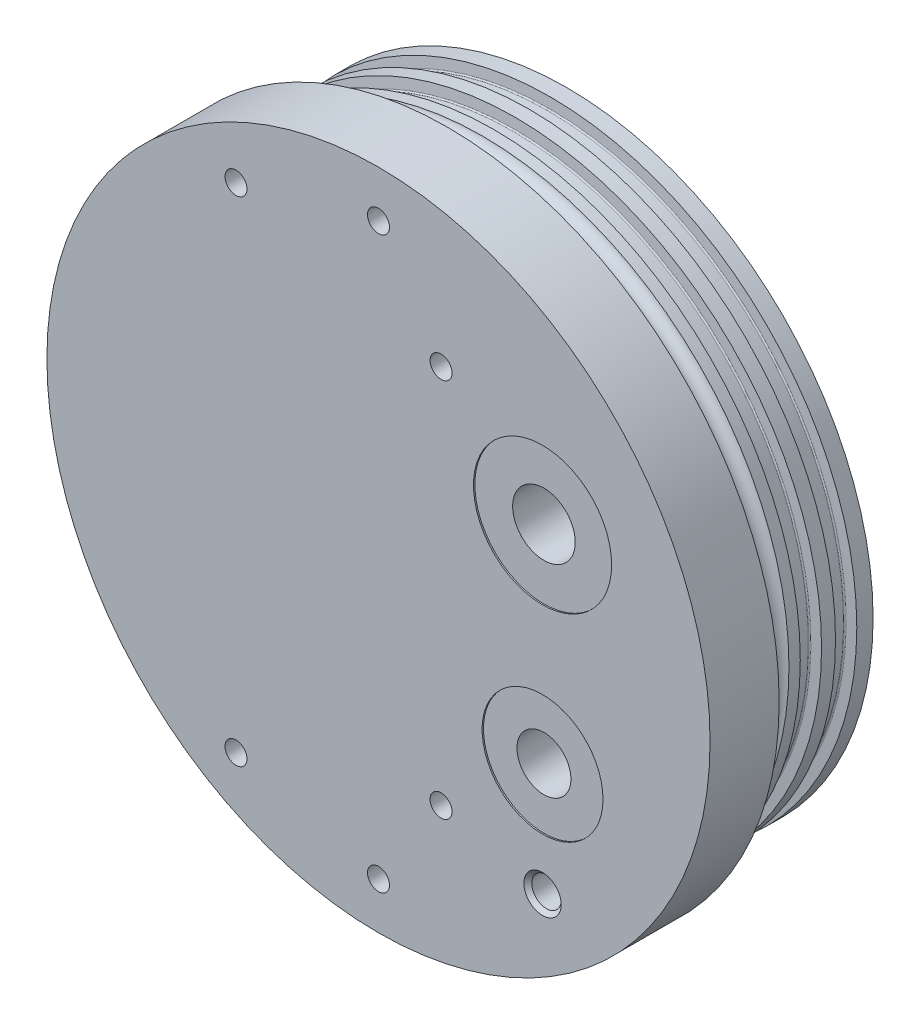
ISO-10303-21;
HEADER;
FILE_DESCRIPTION(('STEP AP214'),'2;1');
FILE_NAME('part.step','',(''),(''),'','','');
FILE_SCHEMA(('AUTOMOTIVE_DESIGN { 1 0 10303 214 1 1 1 1 }'));
ENDSEC;
DATA;
#1=APPLICATION_CONTEXT('core data for automotive mechanical design processes');
#2=APPLICATION_PROTOCOL_DEFINITION('international standard','automotive_design',2000,#1);
#3=PRODUCT_CONTEXT('',#1,'mechanical');
#4=PRODUCT('Part','Part','',(#3));
#5=PRODUCT_RELATED_PRODUCT_CATEGORY('part','',(#4));
#6=PRODUCT_DEFINITION_FORMATION('','',#4);
#7=PRODUCT_DEFINITION_CONTEXT('part definition',#1,'design');
#8=PRODUCT_DEFINITION('design','',#6,#7);
#9=PRODUCT_DEFINITION_SHAPE('','',#8);
#10=(LENGTH_UNIT() NAMED_UNIT(*) SI_UNIT(.MILLI.,.METRE.));
#11=(NAMED_UNIT(*) PLANE_ANGLE_UNIT() SI_UNIT($,.RADIAN.));
#12=(NAMED_UNIT(*) SI_UNIT($,.STERADIAN.) SOLID_ANGLE_UNIT());
#13=UNCERTAINTY_MEASURE_WITH_UNIT(LENGTH_MEASURE(1.E-05),#10,'distance_accuracy_value','');
#14=(GEOMETRIC_REPRESENTATION_CONTEXT(3) GLOBAL_UNCERTAINTY_ASSIGNED_CONTEXT((#13)) GLOBAL_UNIT_ASSIGNED_CONTEXT((#10,
#11,#12)) REPRESENTATION_CONTEXT('',''));
#15=CARTESIAN_POINT('',(0.,0.,0.));
#16=DIRECTION('',(0.,0.,1.));
#17=DIRECTION('',(1.,0.,0.));
#18=AXIS2_PLACEMENT_3D('',#15,#16,#17);
#19=CARTESIAN_POINT('',(0.,0.,12.7));
#20=DIRECTION('',(0.,0.,1.));
#21=DIRECTION('',(1.,0.,0.));
#22=AXIS2_PLACEMENT_3D('',#19,#20,#21);
#23=PLANE('',#22);
#24=CARTESIAN_POINT('',(0.,0.,12.7));
#25=DIRECTION('',(0.,0.,1.));
#26=DIRECTION('',(1.,0.,0.));
#27=AXIS2_PLACEMENT_3D('',#24,#25,#26);
#28=CIRCLE('',#27,60.96);
#29=CARTESIAN_POINT('',(60.96,0.,12.7));
#30=VERTEX_POINT('',#29);
#31=EDGE_CURVE('E208',#30,#30,#28,.T.);
#32=ORIENTED_EDGE('',*,*,#31,.T.);
#33=EDGE_LOOP('',(#32));
#34=FACE_BOUND('',#33,.T.);
#35=CARTESIAN_POINT('',(30.1625,-19.05,12.7));
#36=DIRECTION('',(0.,0.,1.));
#37=DIRECTION('',(1.,0.,0.));
#38=AXIS2_PLACEMENT_3D('',#35,#36,#37);
#39=CIRCLE('',#38,11.1125);
#40=CARTESIAN_POINT('',(41.275,-19.05,12.7));
#41=VERTEX_POINT('',#40);
#42=EDGE_CURVE('E147',#41,#41,#39,.T.);
#43=ORIENTED_EDGE('',*,*,#42,.F.);
#44=EDGE_LOOP('',(#43));
#45=FACE_BOUND('',#44,.T.);
#46=CARTESIAN_POINT('',(30.1625,19.05,12.7));
#47=DIRECTION('',(0.,0.,1.));
#48=DIRECTION('',(1.,0.,0.));
#49=AXIS2_PLACEMENT_3D('',#46,#47,#48);
#50=CIRCLE('',#49,12.7);
#51=CARTESIAN_POINT('',(42.8625,19.05,12.7));
#52=VERTEX_POINT('',#51);
#53=EDGE_CURVE('E136',#52,#52,#50,.T.);
#54=ORIENTED_EDGE('',*,*,#53,.F.);
#55=EDGE_LOOP('',(#54));
#56=FACE_BOUND('',#55,.T.);
#57=CARTESIAN_POINT('',(0.,-52.3875,12.7));
#58=DIRECTION('',(0.,0.,1.));
#59=DIRECTION('',(1.,0.,0.));
#60=AXIS2_PLACEMENT_3D('',#57,#58,#59);
#61=CIRCLE('',#60,2.0193);
#62=CARTESIAN_POINT('',(2.0193,-52.3875,12.7));
#63=VERTEX_POINT('',#62);
#64=EDGE_CURVE('E130',#63,#63,#61,.T.);
#65=ORIENTED_EDGE('',*,*,#64,.F.);
#66=EDGE_LOOP('',(#65));
#67=FACE_BOUND('',#66,.T.);
#68=CARTESIAN_POINT('',(-26.19375,-45.3689058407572,12.7));
#69=DIRECTION('',(0.,0.,1.));
#70=DIRECTION('',(0.866025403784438,-0.500000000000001,0.));
#71=AXIS2_PLACEMENT_3D('',#68,#69,#70);
#72=CIRCLE('',#71,2.0193);
#73=CARTESIAN_POINT('',(-24.4449849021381,-46.3785558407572,12.7));
#74=VERTEX_POINT('',#73);
#75=EDGE_CURVE('E124',#74,#74,#72,.T.);
#76=ORIENTED_EDGE('',*,*,#75,.F.);
#77=EDGE_LOOP('',(#76));
#78=FACE_BOUND('',#77,.T.);
#79=CARTESIAN_POINT('',(-26.1937499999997,45.3689058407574,12.7));
#80=DIRECTION('',(0.,0.,1.));
#81=DIRECTION('',(-0.866025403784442,-0.499999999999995,0.));
#82=AXIS2_PLACEMENT_3D('',#79,#80,#81);
#83=CIRCLE('',#82,2.0193);
#84=CARTESIAN_POINT('',(-27.9425150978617,44.3592558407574,12.7));
#85=VERTEX_POINT('',#84);
#86=EDGE_CURVE('E118',#85,#85,#83,.T.);
#87=ORIENTED_EDGE('',*,*,#86,.F.);
#88=EDGE_LOOP('',(#87));
#89=FACE_BOUND('',#88,.T.);
#90=CARTESIAN_POINT('',(0.,52.3875,12.7));
#91=DIRECTION('',(0.,0.,1.));
#92=DIRECTION('',(-1.,0.,0.));
#93=AXIS2_PLACEMENT_3D('',#90,#91,#92);
#94=CIRCLE('',#93,2.0193);
#95=CARTESIAN_POINT('',(-2.0193,52.3875,12.7));
#96=VERTEX_POINT('',#95);
#97=EDGE_CURVE('E112',#96,#96,#94,.T.);
#98=ORIENTED_EDGE('',*,*,#97,.F.);
#99=EDGE_LOOP('',(#98));
#100=FACE_BOUND('',#99,.T.);
#101=CARTESIAN_POINT('',(11.5062,-34.925,12.7));
#102=DIRECTION('',(0.,0.,1.));
#103=DIRECTION('',(1.,0.,0.));
#104=AXIS2_PLACEMENT_3D('',#101,#102,#103);
#105=CIRCLE('',#104,2.01929999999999);
#106=CARTESIAN_POINT('',(13.5255,-34.925,12.7));
#107=VERTEX_POINT('',#106);
#108=EDGE_CURVE('E99',#107,#107,#105,.T.);
#109=ORIENTED_EDGE('',*,*,#108,.F.);
#110=EDGE_LOOP('',(#109));
#111=FACE_BOUND('',#110,.T.);
#112=CARTESIAN_POINT('',(11.5062,34.925,12.7));
#113=DIRECTION('',(0.,0.,1.));
#114=DIRECTION('',(1.,0.,0.));
#115=AXIS2_PLACEMENT_3D('',#112,#113,#114);
#116=CIRCLE('',#115,2.01929999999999);
#117=CARTESIAN_POINT('',(13.5255,34.925,12.7));
#118=VERTEX_POINT('',#117);
#119=EDGE_CURVE('E100',#118,#118,#116,.T.);
#120=ORIENTED_EDGE('',*,*,#119,.F.);
#121=EDGE_LOOP('',(#120));
#122=FACE_BOUND('',#121,.T.);
#123=CARTESIAN_POINT('',(30.1625,-39.6875,12.6999999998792));
#124=DIRECTION('',(0.,0.,1.));
#125=DIRECTION('',(1.,0.,0.));
#126=AXIS2_PLACEMENT_3D('',#123,#124,#125);
#127=CIRCLE('',#126,3.42899703);
#128=CARTESIAN_POINT('',(33.59149703,-39.6875,12.6999999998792));
#129=VERTEX_POINT('',#128);
#130=EDGE_CURVE('E106',#129,#129,#127,.T.);
#131=ORIENTED_EDGE('',*,*,#130,.F.);
#132=EDGE_LOOP('',(#131));
#133=FACE_BOUND('',#132,.T.);
#134=ADVANCED_FACE('F38',(#34,#45,#56,#67,#78,#89,#100,#111,#122,#133),#23,.T.);
#135=CARTESIAN_POINT('',(30.1625,19.05,12.7));
#136=DIRECTION('',(0.,0.,1.));
#137=DIRECTION('',(1.,0.,0.));
#138=AXIS2_PLACEMENT_3D('',#135,#136,#137);
#139=CYLINDRICAL_SURFACE('',#138,5.75436999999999);
#140=CARTESIAN_POINT('',(30.1625,19.05,-3.175));
#141=DIRECTION('',(0.,0.,-1.));
#142=DIRECTION('',(0.,1.,0.));
#143=AXIS2_PLACEMENT_3D('',#140,#141,#142);
#144=CIRCLE('',#143,5.75436999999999);
#145=CARTESIAN_POINT('',(35.7870391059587,17.8345437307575,-3.175));
#146=VERTEX_POINT('',#145);
#147=CARTESIAN_POINT('',(31.4818602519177,24.6510769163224,-3.17500000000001));
#148=VERTEX_POINT('',#147);
#149=EDGE_CURVE('E57',#146,#148,#144,.T.);
#150=ORIENTED_EDGE('',*,*,#149,.T.);
#151=CARTESIAN_POINT('',(31.4816804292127,24.6511192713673,-3.1748));
#152=CARTESIAN_POINT('',(31.6060276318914,24.6217953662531,-3.31307528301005));
#153=CARTESIAN_POINT('',(31.7319293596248,24.587805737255,-3.44910827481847));
#154=CARTESIAN_POINT('',(31.9868954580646,24.5091506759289,-3.71576299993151));
#155=CARTESIAN_POINT('',(32.1159680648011,24.4644540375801,-3.84636758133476));
#156=CARTESIAN_POINT('',(32.3786479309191,24.3624002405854,-4.10241121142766));
#157=CARTESIAN_POINT('',(32.5122946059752,24.3048544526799,-4.22773624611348));
#158=CARTESIAN_POINT('',(32.7812969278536,24.1760990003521,-4.46887211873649));
#159=CARTESIAN_POINT('',(32.9166502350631,24.1049064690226,-4.58469462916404));
#160=CARTESIAN_POINT('',(33.2194134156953,23.9290726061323,-4.82979891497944));
#161=CARTESIAN_POINT('',(33.3870495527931,23.8205044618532,-4.95606704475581));
#162=CARTESIAN_POINT('',(33.7195278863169,23.5779527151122,-5.18407978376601));
#163=CARTESIAN_POINT('',(33.8843796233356,23.4440934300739,-5.28593903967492));
#164=CARTESIAN_POINT('',(34.1793003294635,23.1744335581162,-5.44374424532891));
#165=CARTESIAN_POINT('',(34.31053568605,23.0427922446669,-5.50454229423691));
#166=CARTESIAN_POINT('',(34.5636089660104,22.7619609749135,-5.60017558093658));
#167=CARTESIAN_POINT('',(34.6854485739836,22.6127741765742,-5.63501548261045));
#168=CARTESIAN_POINT('',(34.9155621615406,22.2994737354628,-5.67568289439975));
#169=CARTESIAN_POINT('',(35.0237737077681,22.1352969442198,-5.68138130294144));
#170=CARTESIAN_POINT('',(35.2221171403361,21.7979715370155,-5.66283765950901));
#171=CARTESIAN_POINT('',(35.3122465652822,21.6248217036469,-5.63859153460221));
#172=CARTESIAN_POINT('',(35.466869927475,21.2879442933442,-5.56519543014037));
#173=CARTESIAN_POINT('',(35.5327257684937,21.1244160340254,-5.51792731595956));
#174=CARTESIAN_POINT('',(35.647413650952,20.7988083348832,-5.40287922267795));
#175=CARTESIAN_POINT('',(35.69624653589,20.6367288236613,-5.33510026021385));
#176=CARTESIAN_POINT('',(35.7997310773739,20.2323736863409,-5.14243097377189));
#177=CARTESIAN_POINT('',(35.8439060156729,19.9928109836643,-5.00626116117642));
#178=CARTESIAN_POINT('',(35.9018657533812,19.5274257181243,-4.70525868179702));
#179=CARTESIAN_POINT('',(35.9154868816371,19.3016834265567,-4.54027672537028));
#180=CARTESIAN_POINT('',(35.9174372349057,18.9706863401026,-4.27425944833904));
#181=CARTESIAN_POINT('',(35.9147508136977,18.8594717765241,-4.18040721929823));
#182=CARTESIAN_POINT('',(35.9033814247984,18.6413556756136,-3.98808690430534));
#183=CARTESIAN_POINT('',(35.894696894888,18.5344552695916,-3.88961762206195));
#184=CARTESIAN_POINT('',(35.8721320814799,18.3263321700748,-3.69016020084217));
#185=CARTESIAN_POINT('',(35.8583217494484,18.2250532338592,-3.58922233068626));
#186=CARTESIAN_POINT('',(35.8260309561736,18.0266495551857,-3.3842320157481));
#187=CARTESIAN_POINT('',(35.807554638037,17.9295212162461,-3.28018240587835));
#188=CARTESIAN_POINT('',(35.7870000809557,17.8343631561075,-3.1748));
#189=B_SPLINE_CURVE_WITH_KNOTS('',3,(#151,#152,#153,#154,#155,#156,#157,#158,#159,#160,#161,
#162,#163,#164,#165,#166,#167,#168,#169,#170,#171,#172,#173,#174,#175,#176,#177,#178,#179,#180,
#181,#182,#183,#184,#185,#186,#187,#188),.UNSPECIFIED.,.F.,.F.,(4,2,2,2,2,2,2,2,2,2,2,2,2,2,2,2,
2,2,4),(0.,0.564862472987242,1.13139173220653,1.70685961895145,2.28160969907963,
2.98829598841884,3.69159494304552,4.27591662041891,4.86013328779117,5.44693590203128,
6.03381833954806,6.57920883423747,7.12457230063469,7.95711406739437,8.79410506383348,
9.23053424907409,9.66707714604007,10.0978693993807,10.5282804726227),.UNSPECIFIED.);
#190=EDGE_CURVE('E11',#148,#146,#189,.T.);
#191=ORIENTED_EDGE('',*,*,#190,.T.);
#192=EDGE_LOOP('',(#150,#191));
#193=FACE_BOUND('',#192,.T.);
#194=CARTESIAN_POINT('',(30.1625,19.05,12.446));
#195=DIRECTION('',(0.,0.,1.));
#196=DIRECTION('',(1.,0.,0.));
#197=AXIS2_PLACEMENT_3D('',#194,#195,#196);
#198=CIRCLE('',#197,5.75436999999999);
#199=CARTESIAN_POINT('',(35.91687,19.05,12.446));
#200=VERTEX_POINT('',#199);
#201=EDGE_CURVE('E140',#200,#200,#198,.F.);
#202=ORIENTED_EDGE('',*,*,#201,.F.);
#203=EDGE_LOOP('',(#202));
#204=FACE_BOUND('',#203,.T.);
#205=ADVANCED_FACE('F230',(#193,#204),#139,.F.);
#206=CARTESIAN_POINT('',(30.1625,-19.05,12.7));
#207=DIRECTION('',(0.,0.,1.));
#208=DIRECTION('',(1.,0.,0.));
#209=AXIS2_PLACEMENT_3D('',#206,#207,#208);
#210=CYLINDRICAL_SURFACE('',#209,4.96061999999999);
#211=CARTESIAN_POINT('',(30.1625,-19.05,-3.17500000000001));
#212=DIRECTION('',(0.,0.,-1.));
#213=DIRECTION('',(0.,1.,0.));
#214=AXIS2_PLACEMENT_3D('',#211,#212,#213);
#215=CIRCLE('',#214,4.96061999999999);
#216=CARTESIAN_POINT('',(32.3477058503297,-23.50338367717,-3.17500000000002));
#217=VERTEX_POINT('',#216);
#218=CARTESIAN_POINT('',(35.1227626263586,-19.109543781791,-3.17500000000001));
#219=VERTEX_POINT('',#218);
#220=EDGE_CURVE('E151',#217,#219,#215,.T.);
#221=ORIENTED_EDGE('',*,*,#220,.T.);
#222=CARTESIAN_POINT('',(35.1227655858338,-19.1092967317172,-3.1748));
#223=CARTESIAN_POINT('',(35.1217857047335,-19.1902253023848,-3.24030280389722));
#224=CARTESIAN_POINT('',(35.1188329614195,-19.2724131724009,-3.30417321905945));
#225=CARTESIAN_POINT('',(35.1085222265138,-19.4394405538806,-3.42819067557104));
#226=CARTESIAN_POINT('',(35.1011585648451,-19.5242833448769,-3.48833281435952));
#227=CARTESIAN_POINT('',(35.0714749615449,-19.7852764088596,-3.66397888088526));
#228=CARTESIAN_POINT('',(35.0415622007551,-19.9654478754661,-3.77268768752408));
#229=CARTESIAN_POINT('',(34.9786813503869,-20.2421478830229,-3.91741386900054));
#230=CARTESIAN_POINT('',(34.9545637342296,-20.3359078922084,-3.96276780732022));
#231=CARTESIAN_POINT('',(34.899847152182,-20.5247679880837,-4.04612612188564));
#232=CARTESIAN_POINT('',(34.8692527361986,-20.6198670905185,-4.0841356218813));
#233=CARTESIAN_POINT('',(34.8014732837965,-20.8100591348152,-4.15160540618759));
#234=CARTESIAN_POINT('',(34.7643286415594,-20.9051487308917,-4.1811153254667));
#235=CARTESIAN_POINT('',(34.683232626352,-21.0948357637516,-4.23094611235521));
#236=CARTESIAN_POINT('',(34.6392833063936,-21.1894333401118,-4.25126974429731));
#237=CARTESIAN_POINT('',(34.5516213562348,-21.3633149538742,-4.27977149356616));
#238=CARTESIAN_POINT('',(34.5087983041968,-21.4428306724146,-4.28928333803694));
#239=CARTESIAN_POINT('',(34.4186099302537,-21.5997977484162,-4.30078942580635));
#240=CARTESIAN_POINT('',(34.3712452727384,-21.6772494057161,-4.30278476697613));
#241=CARTESIAN_POINT('',(34.2724060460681,-21.8293246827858,-4.29919559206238));
#242=CARTESIAN_POINT('',(34.2209307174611,-21.9039477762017,-4.29360967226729));
#243=CARTESIAN_POINT('',(34.1144656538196,-22.0496454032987,-4.27503308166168));
#244=CARTESIAN_POINT('',(34.0594761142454,-22.1207201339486,-4.26204282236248));
#245=CARTESIAN_POINT('',(33.9068611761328,-22.3073796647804,-4.21736332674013));
#246=CARTESIAN_POINT('',(33.8064361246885,-22.4191340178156,-4.17894864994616));
#247=CARTESIAN_POINT('',(33.6000399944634,-22.6295133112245,-4.08419195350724));
#248=CARTESIAN_POINT('',(33.4940534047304,-22.7280984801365,-4.02779729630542));
#249=CARTESIAN_POINT('',(33.2151508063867,-22.9666454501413,-3.86212526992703));
#250=CARTESIAN_POINT('',(33.0401412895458,-23.0960588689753,-3.74139807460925));
#251=CARTESIAN_POINT('',(32.6915409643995,-23.3225224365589,-3.47448406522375));
#252=CARTESIAN_POINT('',(32.5179522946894,-23.419865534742,-3.32854739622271));
#253=CARTESIAN_POINT('',(32.3474840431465,-23.5034925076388,-3.17479999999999));
#254=B_SPLINE_CURVE_WITH_KNOTS('',3,(#222,#223,#224,#225,#226,#227,#228,#229,#230,#231,#232,
#233,#234,#235,#236,#237,#238,#239,#240,#241,#242,#243,#244,#245,#246,#247,#248,#249,#250,#251,
#252,#253),.UNSPECIFIED.,.F.,.F.,(4,2,2,2,2,2,2,2,2,2,2,2,2,2,2,4),(0.,0.312240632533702,
0.624883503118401,1.25960768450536,1.57997418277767,1.90011636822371,2.2183492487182,
2.53648630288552,2.808496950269,3.08046786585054,3.35248914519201,3.62449530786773,
4.0876985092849,4.55227041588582,5.2948817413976,6.03050831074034),.UNSPECIFIED.);
#255=EDGE_CURVE('E51',#219,#217,#254,.T.);
#256=ORIENTED_EDGE('',*,*,#255,.T.);
#257=EDGE_LOOP('',(#221,#256));
#258=FACE_BOUND('',#257,.T.);
#259=CARTESIAN_POINT('',(30.1625,-19.05,12.446));
#260=DIRECTION('',(0.,0.,1.));
#261=DIRECTION('',(1.,0.,0.));
#262=AXIS2_PLACEMENT_3D('',#259,#260,#261);
#263=CIRCLE('',#262,4.96061999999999);
#264=CARTESIAN_POINT('',(35.12312,-19.05,12.446));
#265=VERTEX_POINT('',#264);
#266=EDGE_CURVE('E146',#265,#265,#263,.F.);
#267=ORIENTED_EDGE('',*,*,#266,.F.);
#268=EDGE_LOOP('',(#267));
#269=FACE_BOUND('',#268,.T.);
#270=ADVANCED_FACE('F226',(#258,#269),#210,.F.);
#271=CARTESIAN_POINT('',(0.,0.,12.7));
#272=DIRECTION('',(0.,0.,-1.));
#273=DIRECTION('',(-1.,0.,0.));
#274=AXIS2_PLACEMENT_3D('',#271,#272,#273);
#275=CYLINDRICAL_SURFACE('',#274,60.96);
#276=ORIENTED_EDGE('',*,*,#31,.F.);
#277=EDGE_LOOP('',(#276));
#278=FACE_BOUND('',#277,.T.);
#279=CARTESIAN_POINT('',(0.,0.,0.));
#280=DIRECTION('',(0.,0.,1.));
#281=DIRECTION('',(1.,0.,0.));
#282=AXIS2_PLACEMENT_3D('',#279,#280,#281);
#283=CIRCLE('',#282,60.96);
#284=CARTESIAN_POINT('',(60.96,0.,0.));
#285=VERTEX_POINT('',#284);
#286=EDGE_CURVE('E207',#285,#285,#283,.T.);
#287=ORIENTED_EDGE('',*,*,#286,.T.);
#288=EDGE_LOOP('',(#287));
#289=FACE_BOUND('',#288,.T.);
#290=ADVANCED_FACE('F40',(#278,#289),#275,.T.);
#291=CARTESIAN_POINT('',(0.,0.,0.));
#292=DIRECTION('',(0.,0.,1.));
#293=DIRECTION('',(1.,0.,0.));
#294=AXIS2_PLACEMENT_3D('',#291,#292,#293);
#295=PLANE('',#294);
#296=CARTESIAN_POINT('',(0.,0.,0.));
#297=DIRECTION('',(0.,0.,-1.));
#298=DIRECTION('',(0.,1.,0.));
#299=AXIS2_PLACEMENT_3D('',#296,#297,#298);
#300=CIRCLE('',#299,56.7055);
#301=CARTESIAN_POINT('',(0.,56.7055,0.));
#302=VERTEX_POINT('',#301);
#303=EDGE_CURVE('E198',#302,#302,#300,.T.);
#304=ORIENTED_EDGE('',*,*,#303,.F.);
#305=EDGE_LOOP('',(#304));
#306=FACE_BOUND('',#305,.T.);
#307=ORIENTED_EDGE('',*,*,#286,.F.);
#308=EDGE_LOOP('',(#307));
#309=FACE_BOUND('',#308,.T.);
#310=ADVANCED_FACE('F301',(#306,#309),#295,.F.);
#311=CARTESIAN_POINT('',(0.,0.,0.));
#312=DIRECTION('',(0.,0.,-1.));
#313=DIRECTION('',(0.,1.,0.));
#314=AXIS2_PLACEMENT_3D('',#311,#312,#313);
#315=CYLINDRICAL_SURFACE('',#314,56.3245);
#316=CARTESIAN_POINT('',(0.,0.,-6.43851118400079));
#317=DIRECTION('',(0.,0.,-1.));
#318=DIRECTION('',(0.,1.,0.));
#319=AXIS2_PLACEMENT_3D('',#316,#317,#318);
#320=CIRCLE('',#319,56.3245);
#321=CARTESIAN_POINT('',(0.,56.3245,-6.43851118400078));
#322=VERTEX_POINT('',#321);
#323=EDGE_CURVE('E204',#322,#322,#320,.T.);
#324=ORIENTED_EDGE('',*,*,#323,.T.);
#325=EDGE_LOOP('',(#324));
#326=FACE_BOUND('',#325,.T.);
#327=CARTESIAN_POINT('',(0.,0.,-8.52172303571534));
#328=DIRECTION('',(0.,0.,-1.));
#329=DIRECTION('',(0.,1.,0.));
#330=AXIS2_PLACEMENT_3D('',#327,#328,#329);
#331=CIRCLE('',#330,56.3245);
#332=CARTESIAN_POINT('',(0.,56.3245,-8.52172303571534));
#333=VERTEX_POINT('',#332);
#334=EDGE_CURVE('E153',#333,#333,#331,.T.);
#335=ORIENTED_EDGE('',*,*,#334,.F.);
#336=EDGE_LOOP('',(#335));
#337=FACE_BOUND('',#336,.T.);
#338=ADVANCED_FACE('F299',(#326,#337),#315,.T.);
#339=CARTESIAN_POINT('',(0.,0.,-4.57200000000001));
#340=DIRECTION('',(0.,0.,-1.));
#341=DIRECTION('',(0.,1.,0.));
#342=AXIS2_PLACEMENT_3D('',#339,#340,#341);
#343=TOROIDAL_SURFACE('',#342,56.7055,1.905);
#344=CARTESIAN_POINT('',(0.,0.,-2.66700000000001));
#345=DIRECTION('',(0.,0.,-1.));
#346=DIRECTION('',(0.,1.,0.));
#347=AXIS2_PLACEMENT_3D('',#344,#345,#346);
#348=CIRCLE('',#347,56.7055);
#349=CARTESIAN_POINT('',(0.,56.7055,-2.667));
#350=VERTEX_POINT('',#349);
#351=EDGE_CURVE('E201',#350,#350,#348,.T.);
#352=ORIENTED_EDGE('',*,*,#351,.T.);
#353=EDGE_LOOP('',(#352));
#354=FACE_BOUND('',#353,.T.);
#355=ORIENTED_EDGE('',*,*,#323,.F.);
#356=EDGE_LOOP('',(#355));
#357=FACE_BOUND('',#356,.T.);
#358=ADVANCED_FACE('F308',(#354,#357),#343,.F.);
#359=CARTESIAN_POINT('',(0.,0.,0.));
#360=DIRECTION('',(0.,0.,-1.));
#361=DIRECTION('',(0.,1.,0.));
#362=AXIS2_PLACEMENT_3D('',#359,#360,#361);
#363=CYLINDRICAL_SURFACE('',#362,56.7055);
#364=ORIENTED_EDGE('',*,*,#303,.T.);
#365=EDGE_LOOP('',(#364));
#366=FACE_BOUND('',#365,.T.);
#367=ORIENTED_EDGE('',*,*,#351,.F.);
#368=EDGE_LOOP('',(#367));
#369=FACE_BOUND('',#368,.T.);
#370=ADVANCED_FACE('F316',(#366,#369),#363,.T.);
#371=CARTESIAN_POINT('',(0.,39.9847860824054,-3.175));
#372=DIRECTION('',(0.,0.,-1.));
#373=DIRECTION('',(0.,1.,0.));
#374=AXIS2_PLACEMENT_3D('',#371,#372,#373);
#375=PLANE('',#374);
#376=ORIENTED_EDGE('',*,*,#149,.F.);
#377=CARTESIAN_POINT('',(0.,0.,-3.17500000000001));
#378=DIRECTION('',(0.,0.,-1.));
#379=DIRECTION('',(0.,1.,0.));
#380=AXIS2_PLACEMENT_3D('',#377,#378,#379);
#381=CIRCLE('',#380,39.9847860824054);
#382=EDGE_CURVE('E64',#146,#219,#381,.T.);
#383=ORIENTED_EDGE('',*,*,#382,.T.);
#384=ORIENTED_EDGE('',*,*,#220,.F.);
#385=EDGE_CURVE('E195',#217,#148,#381,.T.);
#386=ORIENTED_EDGE('',*,*,#385,.T.);
#387=EDGE_LOOP('',(#376,#383,#384,#386));
#388=FACE_BOUND('',#387,.T.);
#389=ADVANCED_FACE('F288',(#388),#375,.T.);
#390=CARTESIAN_POINT('',(0.,0.,-3.17500000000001));
#391=DIRECTION('',(0.,0.,-1.));
#392=DIRECTION('',(0.,1.,0.));
#393=AXIS2_PLACEMENT_3D('',#390,#391,#392);
#394=CONICAL_SURFACE('',#393,39.9847860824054,0.523598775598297);
#395=CARTESIAN_POINT('',(30.1990783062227,-40.4804067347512,-21.3947039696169));
#396=CARTESIAN_POINT('',(30.1695158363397,-40.4817718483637,-21.3659815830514));
#397=CARTESIAN_POINT('',(30.1410440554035,-40.4814381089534,-21.3360608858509));
#398=CARTESIAN_POINT('',(30.0861125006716,-40.478043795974,-21.2745550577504));
#399=CARTESIAN_POINT('',(30.0596551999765,-40.4749799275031,-21.2429679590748));
#400=CARTESIAN_POINT('',(29.9827677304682,-40.4623915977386,-21.1460951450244));
#401=CARTESIAN_POINT('',(29.9351376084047,-40.4494671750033,-21.0790198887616));
#402=CARTESIAN_POINT('',(29.8518637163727,-40.4191030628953,-20.950988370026));
#403=CARTESIAN_POINT('',(29.8154658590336,-40.4024312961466,-20.8903174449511));
#404=CARTESIAN_POINT('',(29.7470358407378,-40.3649596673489,-20.7677358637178));
#405=CARTESIAN_POINT('',(29.7150072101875,-40.3441565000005,-20.7058242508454));
#406=CARTESIAN_POINT('',(29.6550627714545,-40.2990173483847,-20.5813077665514));
#407=CARTESIAN_POINT('',(29.6271476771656,-40.2746807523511,-20.5187027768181));
#408=CARTESIAN_POINT('',(29.5753023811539,-40.2228333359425,-20.393155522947));
#409=CARTESIAN_POINT('',(29.5513725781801,-40.1953221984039,-20.3302132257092));
#410=CARTESIAN_POINT('',(29.5059775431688,-40.1353066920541,-20.1998883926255));
#411=CARTESIAN_POINT('',(29.4848021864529,-40.1025875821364,-20.1325035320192));
#412=CARTESIAN_POINT('',(29.4472275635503,-40.0338519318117,-19.9980355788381));
#413=CARTESIAN_POINT('',(29.4308306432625,-39.9978337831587,-19.9309526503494));
#414=CARTESIAN_POINT('',(29.4032832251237,-39.9225237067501,-19.7976195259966));
#415=CARTESIAN_POINT('',(29.392127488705,-39.8832350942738,-19.7313685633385));
#416=CARTESIAN_POINT('',(29.3758315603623,-39.801247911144,-19.6003290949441));
#417=CARTESIAN_POINT('',(29.3706848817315,-39.7585530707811,-19.5355390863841));
#418=CARTESIAN_POINT('',(29.3676983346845,-39.6693943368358,-19.4082988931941));
#419=CARTESIAN_POINT('',(29.3698568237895,-39.6229312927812,-19.3458481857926));
#420=CARTESIAN_POINT('',(29.3803253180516,-39.5502718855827,-19.2556049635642));
#421=CARTESIAN_POINT('',(29.3850033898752,-39.525610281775,-19.2261516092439));
#422=CARTESIAN_POINT('',(29.3972169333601,-39.4752411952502,-19.1687875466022));
#423=CARTESIAN_POINT('',(29.4047495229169,-39.4495347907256,-19.1408753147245));
#424=CARTESIAN_POINT('',(29.4220210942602,-39.4006041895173,-19.0908377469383));
#425=CARTESIAN_POINT('',(29.4313274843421,-39.3775107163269,-19.0684388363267));
#426=CARTESIAN_POINT('',(29.4530456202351,-39.3305931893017,-19.02590400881));
#427=CARTESIAN_POINT('',(29.4654615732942,-39.3067681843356,-19.0057712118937));
#428=CARTESIAN_POINT('',(29.4941603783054,-39.2583557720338,-18.9685395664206));
#429=CARTESIAN_POINT('',(29.5104942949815,-39.233762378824,-18.951486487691));
#430=CARTESIAN_POINT('',(29.5474224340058,-39.1848609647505,-18.9223067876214));
#431=CARTESIAN_POINT('',(29.5680000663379,-39.1605522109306,-18.910161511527));
#432=CARTESIAN_POINT('',(29.6058271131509,-39.1212541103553,-18.8953812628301));
#433=CARTESIAN_POINT('',(29.6219275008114,-39.105840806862,-18.8909295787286));
#434=CARTESIAN_POINT('',(29.6557086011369,-39.0761859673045,-18.885350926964));
#435=CARTESIAN_POINT('',(29.6733882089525,-39.0619436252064,-18.8842216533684));
#436=CARTESIAN_POINT('',(29.7098390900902,-39.0350812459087,-18.8853991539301));
#437=CARTESIAN_POINT('',(29.7286107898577,-39.022461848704,-18.8877072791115));
#438=CARTESIAN_POINT('',(29.7666611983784,-38.9991321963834,-18.8955380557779));
#439=CARTESIAN_POINT('',(29.7859402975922,-38.9884234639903,-18.9010632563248));
#440=CARTESIAN_POINT('',(29.8301805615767,-38.9661234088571,-18.9169252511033));
#441=CARTESIAN_POINT('',(29.8551405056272,-38.9552033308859,-18.9282005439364));
#442=CARTESIAN_POINT('',(29.9043461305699,-38.9364386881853,-18.9542918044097));
#443=CARTESIAN_POINT('',(29.9285902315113,-38.9286005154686,-18.9691150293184));
#444=CARTESIAN_POINT('',(29.9894511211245,-38.9118843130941,-19.0104579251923));
#445=CARTESIAN_POINT('',(30.025307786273,-38.9049268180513,-19.0388503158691));
#446=CARTESIAN_POINT('',(30.0942262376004,-38.895925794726,-19.0995031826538));
#447=CARTESIAN_POINT('',(30.1272804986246,-38.8938951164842,-19.1317735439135));
#448=CARTESIAN_POINT('',(30.1884083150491,-38.8936303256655,-19.1962901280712));
#449=CARTESIAN_POINT('',(30.2166694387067,-38.8951263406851,-19.2283613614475));
#450=CARTESIAN_POINT('',(30.2711613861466,-38.900746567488,-19.2939798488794));
#451=CARTESIAN_POINT('',(30.2973904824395,-38.9048729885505,-19.327528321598));
#452=CARTESIAN_POINT('',(30.3733727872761,-38.9205182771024,-19.4297985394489));
#453=CARTESIAN_POINT('',(30.4203629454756,-38.9353014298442,-19.5000809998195));
#454=CARTESIAN_POINT('',(30.5039218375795,-38.9696523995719,-19.6361077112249));
#455=CARTESIAN_POINT('',(30.5410535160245,-38.9886466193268,-19.7016652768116));
#456=CARTESIAN_POINT('',(30.6106394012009,-39.0310913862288,-19.8338776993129));
#457=CARTESIAN_POINT('',(30.6430898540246,-39.054545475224,-19.900533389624));
#458=CARTESIAN_POINT('',(30.7036039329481,-39.105424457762,-20.0345694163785));
#459=CARTESIAN_POINT('',(30.7316542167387,-39.1328609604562,-20.101951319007));
#460=CARTESIAN_POINT('',(30.7832960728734,-39.1913419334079,-20.2368593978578));
#461=CARTESIAN_POINT('',(30.8068874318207,-39.2223865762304,-20.3043855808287));
#462=CARTESIAN_POINT('',(30.8505719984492,-39.2896462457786,-20.4427391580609));
#463=CARTESIAN_POINT('',(30.8704183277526,-39.3260465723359,-20.5135548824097));
#464=CARTESIAN_POINT('',(30.9045851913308,-39.4026980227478,-20.6545348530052));
#465=CARTESIAN_POINT('',(30.9189007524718,-39.4429525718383,-20.7246984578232));
#466=CARTESIAN_POINT('',(30.9411382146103,-39.5273109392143,-20.8634742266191));
#467=CARTESIAN_POINT('',(30.9490783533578,-39.5714033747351,-20.9320902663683));
#468=CARTESIAN_POINT('',(30.9572485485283,-39.6637343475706,-21.0668218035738));
#469=CARTESIAN_POINT('',(30.9574948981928,-39.7119639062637,-21.1329422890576));
#470=CARTESIAN_POINT('',(30.9485870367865,-39.8058242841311,-21.2517491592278));
#471=CARTESIAN_POINT('',(30.9407827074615,-39.8508276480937,-21.3049981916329));
#472=CARTESIAN_POINT('',(30.921568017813,-39.9208015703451,-21.380397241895));
#473=CARTESIAN_POINT('',(30.9139449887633,-39.9444647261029,-21.4047196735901));
#474=CARTESIAN_POINT('',(30.895727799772,-39.9925877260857,-21.451357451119));
#475=CARTESIAN_POINT('',(30.8851382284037,-40.0170462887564,-21.4736758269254));
#476=CARTESIAN_POINT('',(30.862746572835,-40.0619300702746,-21.5115610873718));
#477=CARTESIAN_POINT('',(30.8515488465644,-40.082246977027,-21.5276077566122));
#478=CARTESIAN_POINT('',(30.8264783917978,-40.1230984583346,-21.5572268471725));
#479=CARTESIAN_POINT('',(30.8126042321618,-40.1436331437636,-21.5707979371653));
#480=CARTESIAN_POINT('',(30.7817513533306,-40.1847255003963,-21.5947618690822));
#481=CARTESIAN_POINT('',(30.7647392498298,-40.2052807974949,-21.6051169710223));
#482=CARTESIAN_POINT('',(30.7277388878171,-40.2454287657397,-21.6214470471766));
#483=CARTESIAN_POINT('',(30.707756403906,-40.2650232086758,-21.6274303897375));
#484=CARTESIAN_POINT('',(30.6671204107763,-40.3007415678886,-21.6339935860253));
#485=CARTESIAN_POINT('',(30.6466707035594,-40.3170189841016,-21.6349920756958));
#486=CARTESIAN_POINT('',(30.6044305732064,-40.3473578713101,-21.6325981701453));
#487=CARTESIAN_POINT('',(30.5826400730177,-40.361419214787,-21.6292055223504));
#488=CARTESIAN_POINT('',(30.5412733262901,-40.3854053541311,-21.6190883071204));
#489=CARTESIAN_POINT('',(30.521751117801,-40.3956254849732,-21.6128205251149));
#490=CARTESIAN_POINT('',(30.4827905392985,-40.4140798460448,-21.5976730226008));
#491=CARTESIAN_POINT('',(30.463352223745,-40.4223129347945,-21.5887918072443));
#492=CARTESIAN_POINT('',(30.4132124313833,-40.4413403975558,-21.5628782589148));
#493=CARTESIAN_POINT('',(30.3828235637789,-40.4506636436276,-21.5441677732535));
#494=CARTESIAN_POINT('',(30.323703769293,-40.4653078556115,-21.5030051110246));
#495=CARTESIAN_POINT('',(30.2949759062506,-40.4706216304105,-21.4805462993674));
#496=CARTESIAN_POINT('',(30.243834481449,-40.4774209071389,-21.436929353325));
#497=CARTESIAN_POINT('',(30.2211523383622,-40.4793874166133,-21.4161507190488));
#498=CARTESIAN_POINT('',(30.1990783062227,-40.4804067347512,-21.3947039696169));
#499=B_SPLINE_CURVE_WITH_KNOTS('',3,(#395,#396,#397,#398,#399,#400,#401,#402,#403,#404,#405,
#406,#407,#408,#409,#410,#411,#412,#413,#414,#415,#416,#417,#418,#419,#420,#421,#422,#423,#424,
#425,#426,#427,#428,#429,#430,#431,#432,#433,#434,#435,#436,#437,#438,#439,#440,#441,#442,#443,
#444,#445,#446,#447,#448,#449,#450,#451,#452,#453,#454,#455,#456,#457,#458,#459,#460,#461,#462,
#463,#464,#465,#466,#467,#468,#469,#470,#471,#472,#473,#474,#475,#476,#477,#478,#479,#480,#481,
#482,#483,#484,#485,#486,#487,#488,#489,#490,#491,#492,#493,#494,#495,#496,#497,#498),
.UNSPECIFIED.,.T.,.F.,(4,2,2,2,2,2,2,2,2,2,2,2,2,2,2,2,2,2,2,2,2,2,2,2,2,2,2,2,2,2,2,2,2,2,2,2,
2,2,2,2,2,2,2,2,2,2,2,2,2,2,2,4),(0.,0.123677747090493,0.247504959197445,0.496496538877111,
0.714313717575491,0.932305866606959,1.15033580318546,1.36838754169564,1.60170662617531,
1.83514006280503,2.06833968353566,2.30128733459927,2.53418261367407,2.65016657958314,
2.76603375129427,2.86632868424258,2.96676005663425,3.06857926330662,3.17000772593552,
3.23790122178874,3.30574758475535,3.37362062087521,3.44154750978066,3.52950885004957,
3.61765167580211,3.75566182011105,3.89403153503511,4.02216004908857,4.15039632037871,
4.40712574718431,4.63995331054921,4.87296655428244,5.10667323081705,5.34039108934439,
5.58630871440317,5.83244695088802,6.07787854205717,6.32279034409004,6.53240047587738,
6.63659624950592,6.74063173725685,6.8250659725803,6.909545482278,6.99498186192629,
7.08025426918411,7.15822853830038,7.23620729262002,7.30467648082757,7.37318490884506,
7.48320741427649,7.59342678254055,7.6857758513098),.UNSPECIFIED.);
#500=CARTESIAN_POINT('',(30.1990783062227,-40.4804067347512,-21.3947039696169));
#501=VERTEX_POINT('',#500);
#502=EDGE_CURVE('E42',#501,#501,#499,.T.);
#503=ORIENTED_EDGE('',*,*,#502,.F.);
#504=EDGE_LOOP('',(#503));
#505=FACE_BOUND('',#504,.T.);
#506=ORIENTED_EDGE('',*,*,#190,.F.);
#507=ORIENTED_EDGE('',*,*,#385,.F.);
#508=ORIENTED_EDGE('',*,*,#255,.F.);
#509=ORIENTED_EDGE('',*,*,#382,.F.);
#510=EDGE_LOOP('',(#506,#507,#508,#509));
#511=FACE_BOUND('',#510,.T.);
#512=CARTESIAN_POINT('',(0.,0.,-21.9075));
#513=DIRECTION('',(0.,0.,-1.));
#514=DIRECTION('',(0.,1.,0.));
#515=AXIS2_PLACEMENT_3D('',#512,#513,#514);
#516=CIRCLE('',#515,50.8);
#517=CARTESIAN_POINT('',(0.,50.8,-21.9075));
#518=VERTEX_POINT('',#517);
#519=EDGE_CURVE('E192',#518,#518,#516,.T.);
#520=ORIENTED_EDGE('',*,*,#519,.T.);
#521=EDGE_LOOP('',(#520));
#522=FACE_BOUND('',#521,.T.);
#523=ADVANCED_FACE('F222',(#505,#511,#522),#394,.F.);
#524=CARTESIAN_POINT('',(0.,56.3245,-21.9075));
#525=DIRECTION('',(0.,0.,-1.));
#526=DIRECTION('',(0.,1.,0.));
#527=AXIS2_PLACEMENT_3D('',#524,#525,#526);
#528=PLANE('',#527);
#529=CARTESIAN_POINT('',(0.,0.,-21.9075));
#530=DIRECTION('',(0.,0.,-1.));
#531=DIRECTION('',(0.,1.,0.));
#532=AXIS2_PLACEMENT_3D('',#529,#530,#531);
#533=CIRCLE('',#532,56.3245);
#534=CARTESIAN_POINT('',(0.,56.3245,-21.9075));
#535=VERTEX_POINT('',#534);
#536=EDGE_CURVE('E189',#535,#535,#533,.T.);
#537=ORIENTED_EDGE('',*,*,#536,.T.);
#538=EDGE_LOOP('',(#537));
#539=FACE_BOUND('',#538,.T.);
#540=ORIENTED_EDGE('',*,*,#519,.F.);
#541=EDGE_LOOP('',(#540));
#542=FACE_BOUND('',#541,.T.);
#543=ADVANCED_FACE('F281',(#539,#542),#528,.T.);
#544=CARTESIAN_POINT('',(0.,0.,0.));
#545=DIRECTION('',(0.,0.,-1.));
#546=DIRECTION('',(0.,1.,0.));
#547=AXIS2_PLACEMENT_3D('',#544,#545,#546);
#548=CYLINDRICAL_SURFACE('',#547,56.3245);
#549=CARTESIAN_POINT('',(0.,0.,-18.9102769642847));
#550=DIRECTION('',(0.,0.,-1.));
#551=DIRECTION('',(0.,1.,0.));
#552=AXIS2_PLACEMENT_3D('',#549,#550,#551);
#553=CIRCLE('',#552,56.3245);
#554=CARTESIAN_POINT('',(0.,56.3245,-18.9102769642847));
#555=VERTEX_POINT('',#554);
#556=EDGE_CURVE('E186',#555,#555,#553,.T.);
#557=ORIENTED_EDGE('',*,*,#556,.T.);
#558=EDGE_LOOP('',(#557));
#559=FACE_BOUND('',#558,.T.);
#560=ORIENTED_EDGE('',*,*,#536,.F.);
#561=EDGE_LOOP('',(#560));
#562=FACE_BOUND('',#561,.T.);
#563=ADVANCED_FACE('F278',(#559,#562),#548,.T.);
#564=CARTESIAN_POINT('',(0.,0.,-18.9102769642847));
#565=DIRECTION('',(0.,0.,-1.));
#566=DIRECTION('',(0.,1.,0.));
#567=AXIS2_PLACEMENT_3D('',#564,#565,#566);
#568=CONICAL_SURFACE('',#567,56.3245,1.48352986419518);
#569=CARTESIAN_POINT('',(0.,0.,-18.7527853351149));
#570=DIRECTION('',(0.,0.,-1.));
#571=DIRECTION('',(0.,1.,0.));
#572=AXIS2_PLACEMENT_3D('',#569,#570,#571);
#573=CIRCLE('',#572,54.5243624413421);
#574=CARTESIAN_POINT('',(0.,54.5243624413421,-18.7527853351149));
#575=VERTEX_POINT('',#574);
#576=EDGE_CURVE('E183',#575,#575,#573,.T.);
#577=ORIENTED_EDGE('',*,*,#576,.T.);
#578=EDGE_LOOP('',(#577));
#579=FACE_BOUND('',#578,.T.);
#580=ORIENTED_EDGE('',*,*,#556,.F.);
#581=EDGE_LOOP('',(#580));
#582=FACE_BOUND('',#581,.T.);
#583=ADVANCED_FACE('F274',(#579,#582),#568,.T.);
#584=CARTESIAN_POINT('',(0.,0.,-18.4997518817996));
#585=DIRECTION('',(0.,0.,-1.));
#586=DIRECTION('',(0.,1.,0.));
#587=AXIS2_PLACEMENT_3D('',#584,#585,#586);
#588=TOROIDAL_SURFACE('',#587,54.5465,0.253999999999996);
#589=CARTESIAN_POINT('',(0.,0.,-18.4997518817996));
#590=DIRECTION('',(0.,0.,-1.));
#591=DIRECTION('',(0.,1.,0.));
#592=AXIS2_PLACEMENT_3D('',#589,#590,#591);
#593=CIRCLE('',#592,54.2925);
#594=CARTESIAN_POINT('',(0.,54.2925,-18.4997518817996));
#595=VERTEX_POINT('',#594);
#596=EDGE_CURVE('E180',#595,#595,#593,.T.);
#597=ORIENTED_EDGE('',*,*,#596,.T.);
#598=EDGE_LOOP('',(#597));
#599=FACE_BOUND('',#598,.T.);
#600=ORIENTED_EDGE('',*,*,#576,.F.);
#601=EDGE_LOOP('',(#600));
#602=FACE_BOUND('',#601,.T.);
#603=ADVANCED_FACE('F270',(#599,#602),#588,.F.);
#604=CARTESIAN_POINT('',(0.,0.,0.));
#605=DIRECTION('',(0.,0.,-1.));
#606=DIRECTION('',(0.,1.,0.));
#607=AXIS2_PLACEMENT_3D('',#604,#605,#606);
#608=CYLINDRICAL_SURFACE('',#607,54.2925);
#609=CARTESIAN_POINT('',(0.,0.,-15.4092481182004));
#610=DIRECTION('',(0.,0.,-1.));
#611=DIRECTION('',(0.,1.,0.));
#612=AXIS2_PLACEMENT_3D('',#609,#610,#611);
#613=CIRCLE('',#612,54.2925);
#614=CARTESIAN_POINT('',(0.,54.2925,-15.4092481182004));
#615=VERTEX_POINT('',#614);
#616=EDGE_CURVE('E177',#615,#615,#613,.T.);
#617=ORIENTED_EDGE('',*,*,#616,.T.);
#618=EDGE_LOOP('',(#617));
#619=FACE_BOUND('',#618,.T.);
#620=ORIENTED_EDGE('',*,*,#596,.F.);
#621=EDGE_LOOP('',(#620));
#622=FACE_BOUND('',#621,.T.);
#623=ADVANCED_FACE('F266',(#619,#622),#608,.T.);
#624=CARTESIAN_POINT('',(0.,0.,-15.4092481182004));
#625=DIRECTION('',(0.,0.,-1.));
#626=DIRECTION('',(0.,1.,0.));
#627=AXIS2_PLACEMENT_3D('',#624,#625,#626);
#628=TOROIDAL_SURFACE('',#627,54.5465,0.253999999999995);
#629=CARTESIAN_POINT('',(0.,0.,-15.1562146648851));
#630=DIRECTION('',(0.,0.,-1.));
#631=DIRECTION('',(0.,1.,0.));
#632=AXIS2_PLACEMENT_3D('',#629,#630,#631);
#633=CIRCLE('',#632,54.5243624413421);
#634=CARTESIAN_POINT('',(0.,54.5243624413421,-15.1562146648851));
#635=VERTEX_POINT('',#634);
#636=EDGE_CURVE('E174',#635,#635,#633,.T.);
#637=ORIENTED_EDGE('',*,*,#636,.T.);
#638=EDGE_LOOP('',(#637));
#639=FACE_BOUND('',#638,.T.);
#640=ORIENTED_EDGE('',*,*,#616,.F.);
#641=EDGE_LOOP('',(#640));
#642=FACE_BOUND('',#641,.T.);
#643=ADVANCED_FACE('F262',(#639,#642),#628,.F.);
#644=CARTESIAN_POINT('',(0.,0.,-15.1562146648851));
#645=DIRECTION('',(0.,0.,1.));
#646=DIRECTION('',(0.,-1.,0.));
#647=AXIS2_PLACEMENT_3D('',#644,#645,#646);
#648=CONICAL_SURFACE('',#647,54.5243624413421,1.48352986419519);
#649=CARTESIAN_POINT('',(0.,0.,-14.9987230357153));
#650=DIRECTION('',(0.,0.,-1.));
#651=DIRECTION('',(0.,1.,0.));
#652=AXIS2_PLACEMENT_3D('',#649,#650,#651);
#653=CIRCLE('',#652,56.3245);
#654=CARTESIAN_POINT('',(0.,56.3245,-14.9987230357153));
#655=VERTEX_POINT('',#654);
#656=EDGE_CURVE('E171',#655,#655,#653,.T.);
#657=ORIENTED_EDGE('',*,*,#656,.T.);
#658=EDGE_LOOP('',(#657));
#659=FACE_BOUND('',#658,.T.);
#660=ORIENTED_EDGE('',*,*,#636,.F.);
#661=EDGE_LOOP('',(#660));
#662=FACE_BOUND('',#661,.T.);
#663=ADVANCED_FACE('F258',(#659,#662),#648,.T.);
#664=CARTESIAN_POINT('',(0.,0.,0.));
#665=DIRECTION('',(0.,0.,-1.));
#666=DIRECTION('',(0.,1.,0.));
#667=AXIS2_PLACEMENT_3D('',#664,#665,#666);
#668=CYLINDRICAL_SURFACE('',#667,56.3245);
#669=CARTESIAN_POINT('',(0.,0.,-12.4332769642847));
#670=DIRECTION('',(0.,0.,-1.));
#671=DIRECTION('',(0.,1.,0.));
#672=AXIS2_PLACEMENT_3D('',#669,#670,#671);
#673=CIRCLE('',#672,56.3245);
#674=CARTESIAN_POINT('',(0.,56.3245,-12.4332769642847));
#675=VERTEX_POINT('',#674);
#676=EDGE_CURVE('E168',#675,#675,#673,.T.);
#677=ORIENTED_EDGE('',*,*,#676,.T.);
#678=EDGE_LOOP('',(#677));
#679=FACE_BOUND('',#678,.T.);
#680=ORIENTED_EDGE('',*,*,#656,.F.);
#681=EDGE_LOOP('',(#680));
#682=FACE_BOUND('',#681,.T.);
#683=ADVANCED_FACE('F254',(#679,#682),#668,.T.);
#684=CARTESIAN_POINT('',(0.,0.,-12.4332769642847));
#685=DIRECTION('',(0.,0.,-1.));
#686=DIRECTION('',(0.,1.,0.));
#687=AXIS2_PLACEMENT_3D('',#684,#685,#686);
#688=CONICAL_SURFACE('',#687,56.3245,1.48352986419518);
#689=CARTESIAN_POINT('',(0.,0.,-12.2757853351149));
#690=DIRECTION('',(0.,0.,-1.));
#691=DIRECTION('',(0.,1.,0.));
#692=AXIS2_PLACEMENT_3D('',#689,#690,#691);
#693=CIRCLE('',#692,54.5243624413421);
#694=CARTESIAN_POINT('',(0.,54.5243624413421,-12.2757853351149));
#695=VERTEX_POINT('',#694);
#696=EDGE_CURVE('E165',#695,#695,#693,.T.);
#697=ORIENTED_EDGE('',*,*,#696,.T.);
#698=EDGE_LOOP('',(#697));
#699=FACE_BOUND('',#698,.T.);
#700=ORIENTED_EDGE('',*,*,#676,.F.);
#701=EDGE_LOOP('',(#700));
#702=FACE_BOUND('',#701,.T.);
#703=ADVANCED_FACE('F250',(#699,#702),#688,.T.);
#704=CARTESIAN_POINT('',(0.,0.,-12.0227518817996));
#705=DIRECTION('',(0.,0.,-1.));
#706=DIRECTION('',(0.,1.,0.));
#707=AXIS2_PLACEMENT_3D('',#704,#705,#706);
#708=TOROIDAL_SURFACE('',#707,54.5465,0.253999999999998);
#709=CARTESIAN_POINT('',(0.,0.,-12.0227518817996));
#710=DIRECTION('',(0.,0.,-1.));
#711=DIRECTION('',(0.,1.,0.));
#712=AXIS2_PLACEMENT_3D('',#709,#710,#711);
#713=CIRCLE('',#712,54.2925);
#714=CARTESIAN_POINT('',(0.,54.2925,-12.0227518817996));
#715=VERTEX_POINT('',#714);
#716=EDGE_CURVE('E162',#715,#715,#713,.T.);
#717=ORIENTED_EDGE('',*,*,#716,.T.);
#718=EDGE_LOOP('',(#717));
#719=FACE_BOUND('',#718,.T.);
#720=ORIENTED_EDGE('',*,*,#696,.F.);
#721=EDGE_LOOP('',(#720));
#722=FACE_BOUND('',#721,.T.);
#723=ADVANCED_FACE('F246',(#719,#722),#708,.F.);
#724=CARTESIAN_POINT('',(0.,0.,0.));
#725=DIRECTION('',(0.,0.,-1.));
#726=DIRECTION('',(0.,1.,0.));
#727=AXIS2_PLACEMENT_3D('',#724,#725,#726);
#728=CYLINDRICAL_SURFACE('',#727,54.2925);
#729=CARTESIAN_POINT('',(0.,0.,-8.93224811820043));
#730=DIRECTION('',(0.,0.,-1.));
#731=DIRECTION('',(0.,1.,0.));
#732=AXIS2_PLACEMENT_3D('',#729,#730,#731);
#733=CIRCLE('',#732,54.2925);
#734=CARTESIAN_POINT('',(0.,54.2925,-8.93224811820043));
#735=VERTEX_POINT('',#734);
#736=EDGE_CURVE('E159',#735,#735,#733,.T.);
#737=ORIENTED_EDGE('',*,*,#736,.T.);
#738=EDGE_LOOP('',(#737));
#739=FACE_BOUND('',#738,.T.);
#740=ORIENTED_EDGE('',*,*,#716,.F.);
#741=EDGE_LOOP('',(#740));
#742=FACE_BOUND('',#741,.T.);
#743=ADVANCED_FACE('F242',(#739,#742),#728,.T.);
#744=CARTESIAN_POINT('',(0.,0.,-8.93224811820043));
#745=DIRECTION('',(0.,0.,-1.));
#746=DIRECTION('',(0.,1.,0.));
#747=AXIS2_PLACEMENT_3D('',#744,#745,#746);
#748=TOROIDAL_SURFACE('',#747,54.5465,0.254000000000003);
#749=CARTESIAN_POINT('',(0.,0.,-8.67921466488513));
#750=DIRECTION('',(0.,0.,-1.));
#751=DIRECTION('',(0.,1.,0.));
#752=AXIS2_PLACEMENT_3D('',#749,#750,#751);
#753=CIRCLE('',#752,54.5243624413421);
#754=CARTESIAN_POINT('',(0.,54.5243624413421,-8.67921466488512));
#755=VERTEX_POINT('',#754);
#756=EDGE_CURVE('E156',#755,#755,#753,.T.);
#757=ORIENTED_EDGE('',*,*,#756,.T.);
#758=EDGE_LOOP('',(#757));
#759=FACE_BOUND('',#758,.T.);
#760=ORIENTED_EDGE('',*,*,#736,.F.);
#761=EDGE_LOOP('',(#760));
#762=FACE_BOUND('',#761,.T.);
#763=ADVANCED_FACE('F238',(#759,#762),#748,.F.);
#764=CARTESIAN_POINT('',(0.,0.,-8.67921466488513));
#765=DIRECTION('',(0.,0.,1.));
#766=DIRECTION('',(0.,-1.,0.));
#767=AXIS2_PLACEMENT_3D('',#764,#765,#766);
#768=CONICAL_SURFACE('',#767,54.5243624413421,1.48352986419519);
#769=ORIENTED_EDGE('',*,*,#334,.T.);
#770=EDGE_LOOP('',(#769));
#771=FACE_BOUND('',#770,.T.);
#772=ORIENTED_EDGE('',*,*,#756,.F.);
#773=EDGE_LOOP('',(#772));
#774=FACE_BOUND('',#773,.T.);
#775=ADVANCED_FACE('F234',(#771,#774),#768,.T.);
#776=CARTESIAN_POINT('',(30.1625,-19.05,12.446));
#777=DIRECTION('',(0.,0.,1.));
#778=DIRECTION('',(1.,0.,0.));
#779=AXIS2_PLACEMENT_3D('',#776,#777,#778);
#780=PLANE('',#779);
#781=CARTESIAN_POINT('',(30.1625,-19.05,12.446));
#782=DIRECTION('',(0.,0.,1.));
#783=DIRECTION('',(1.,0.,0.));
#784=AXIS2_PLACEMENT_3D('',#781,#782,#783);
#785=CIRCLE('',#784,11.1125);
#786=CARTESIAN_POINT('',(41.275,-19.05,12.446));
#787=VERTEX_POINT('',#786);
#788=EDGE_CURVE('E143',#787,#787,#785,.T.);
#789=ORIENTED_EDGE('',*,*,#788,.T.);
#790=EDGE_LOOP('',(#789));
#791=FACE_BOUND('',#790,.T.);
#792=ORIENTED_EDGE('',*,*,#266,.T.);
#793=EDGE_LOOP('',(#792));
#794=FACE_BOUND('',#793,.T.);
#795=ADVANCED_FACE('F237',(#791,#794),#780,.T.);
#796=CARTESIAN_POINT('',(30.1625,-19.05,12.446));
#797=DIRECTION('',(0.,0.,1.));
#798=DIRECTION('',(1.,0.,0.));
#799=AXIS2_PLACEMENT_3D('',#796,#797,#798);
#800=CYLINDRICAL_SURFACE('',#799,11.1125);
#801=ORIENTED_EDGE('',*,*,#788,.F.);
#802=EDGE_LOOP('',(#801));
#803=FACE_BOUND('',#802,.T.);
#804=ORIENTED_EDGE('',*,*,#42,.T.);
#805=EDGE_LOOP('',(#804));
#806=FACE_BOUND('',#805,.T.);
#807=ADVANCED_FACE('F371',(#803,#806),#800,.F.);
#808=CARTESIAN_POINT('',(30.1625,19.05,12.446));
#809=DIRECTION('',(0.,0.,1.));
#810=DIRECTION('',(1.,0.,0.));
#811=AXIS2_PLACEMENT_3D('',#808,#809,#810);
#812=PLANE('',#811);
#813=CARTESIAN_POINT('',(30.1625,19.05,12.446));
#814=DIRECTION('',(0.,0.,1.));
#815=DIRECTION('',(1.,0.,0.));
#816=AXIS2_PLACEMENT_3D('',#813,#814,#815);
#817=CIRCLE('',#816,12.7);
#818=CARTESIAN_POINT('',(42.8625,19.05,12.446));
#819=VERTEX_POINT('',#818);
#820=EDGE_CURVE('E137',#819,#819,#817,.T.);
#821=ORIENTED_EDGE('',*,*,#820,.T.);
#822=EDGE_LOOP('',(#821));
#823=FACE_BOUND('',#822,.T.);
#824=ORIENTED_EDGE('',*,*,#201,.T.);
#825=EDGE_LOOP('',(#824));
#826=FACE_BOUND('',#825,.T.);
#827=ADVANCED_FACE('F367',(#823,#826),#812,.T.);
#828=CARTESIAN_POINT('',(30.1625,19.05,12.446));
#829=DIRECTION('',(0.,0.,1.));
#830=DIRECTION('',(1.,0.,0.));
#831=AXIS2_PLACEMENT_3D('',#828,#829,#830);
#832=CYLINDRICAL_SURFACE('',#831,12.7);
#833=ORIENTED_EDGE('',*,*,#820,.F.);
#834=EDGE_LOOP('',(#833));
#835=FACE_BOUND('',#834,.T.);
#836=ORIENTED_EDGE('',*,*,#53,.T.);
#837=EDGE_LOOP('',(#836));
#838=FACE_BOUND('',#837,.T.);
#839=ADVANCED_FACE('F370',(#835,#838),#832,.F.);
#840=CARTESIAN_POINT('',(0.,-52.3875,0.6604));
#841=DIRECTION('',(0.,0.,1.));
#842=DIRECTION('',(1.,0.,0.));
#843=AXIS2_PLACEMENT_3D('',#840,#841,#842);
#844=CONICAL_SURFACE('',#843,2.0193,1.02974425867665);
#845=CARTESIAN_POINT('',(0.,-52.3875,-0.552917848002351));
#846=VERTEX_POINT('',#845);
#847=VERTEX_LOOP('',#846);
#848=FACE_BOUND('',#847,.T.);
#849=CARTESIAN_POINT('',(0.,-52.3875,0.6604));
#850=DIRECTION('',(0.,0.,1.));
#851=DIRECTION('',(1.,0.,0.));
#852=AXIS2_PLACEMENT_3D('',#849,#850,#851);
#853=CIRCLE('',#852,2.0193);
#854=CARTESIAN_POINT('',(2.0193,-52.3875,0.6604));
#855=VERTEX_POINT('',#854);
#856=EDGE_CURVE('E133',#855,#855,#853,.T.);
#857=ORIENTED_EDGE('',*,*,#856,.T.);
#858=EDGE_LOOP('',(#857));
#859=FACE_BOUND('',#858,.T.);
#860=ADVANCED_FACE('F378',(#848,#859),#844,.F.);
#861=CARTESIAN_POINT('',(0.,-52.3875,12.7));
#862=DIRECTION('',(0.,0.,1.));
#863=DIRECTION('',(1.,0.,0.));
#864=AXIS2_PLACEMENT_3D('',#861,#862,#863);
#865=CYLINDRICAL_SURFACE('',#864,2.0193);
#866=ORIENTED_EDGE('',*,*,#856,.F.);
#867=EDGE_LOOP('',(#866));
#868=FACE_BOUND('',#867,.T.);
#869=ORIENTED_EDGE('',*,*,#64,.T.);
#870=EDGE_LOOP('',(#869));
#871=FACE_BOUND('',#870,.T.);
#872=ADVANCED_FACE('F472',(#868,#871),#865,.F.);
#873=CARTESIAN_POINT('',(-26.19375,-45.3689058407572,0.660400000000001));
#874=DIRECTION('',(0.,0.,1.));
#875=DIRECTION('',(0.866025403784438,-0.500000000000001,0.));
#876=AXIS2_PLACEMENT_3D('',#873,#874,#875);
#877=CONICAL_SURFACE('',#876,2.0193,1.02974425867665);
#878=CARTESIAN_POINT('',(-26.19375,-45.3689058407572,-0.55291784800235));
#879=VERTEX_POINT('',#878);
#880=VERTEX_LOOP('',#879);
#881=FACE_BOUND('',#880,.T.);
#882=CARTESIAN_POINT('',(-26.19375,-45.3689058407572,0.660400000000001));
#883=DIRECTION('',(0.,0.,1.));
#884=DIRECTION('',(0.866025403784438,-0.500000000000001,0.));
#885=AXIS2_PLACEMENT_3D('',#882,#883,#884);
#886=CIRCLE('',#885,2.0193);
#887=CARTESIAN_POINT('',(-24.4449849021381,-46.3785558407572,0.660400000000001));
#888=VERTEX_POINT('',#887);
#889=EDGE_CURVE('E127',#888,#888,#886,.T.);
#890=ORIENTED_EDGE('',*,*,#889,.T.);
#891=EDGE_LOOP('',(#890));
#892=FACE_BOUND('',#891,.T.);
#893=ADVANCED_FACE('F469',(#881,#892),#877,.F.);
#894=CARTESIAN_POINT('',(-26.19375,-45.3689058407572,12.7));
#895=DIRECTION('',(0.,0.,1.));
#896=DIRECTION('',(0.866025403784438,-0.500000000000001,0.));
#897=AXIS2_PLACEMENT_3D('',#894,#895,#896);
#898=CYLINDRICAL_SURFACE('',#897,2.0193);
#899=ORIENTED_EDGE('',*,*,#889,.F.);
#900=EDGE_LOOP('',(#899));
#901=FACE_BOUND('',#900,.T.);
#902=ORIENTED_EDGE('',*,*,#75,.T.);
#903=EDGE_LOOP('',(#902));
#904=FACE_BOUND('',#903,.T.);
#905=ADVANCED_FACE('F465',(#901,#904),#898,.F.);
#906=CARTESIAN_POINT('',(-26.1937499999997,45.3689058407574,0.660400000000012));
#907=DIRECTION('',(0.,0.,1.));
#908=DIRECTION('',(-0.866025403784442,-0.499999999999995,0.));
#909=AXIS2_PLACEMENT_3D('',#906,#907,#908);
#910=CONICAL_SURFACE('',#909,2.0193,1.02974425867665);
#911=CARTESIAN_POINT('',(-26.1937499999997,45.3689058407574,-0.552917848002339));
#912=VERTEX_POINT('',#911);
#913=VERTEX_LOOP('',#912);
#914=FACE_BOUND('',#913,.T.);
#915=CARTESIAN_POINT('',(-26.1937499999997,45.3689058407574,0.660400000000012));
#916=DIRECTION('',(0.,0.,1.));
#917=DIRECTION('',(-0.866025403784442,-0.499999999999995,0.));
#918=AXIS2_PLACEMENT_3D('',#915,#916,#917);
#919=CIRCLE('',#918,2.0193);
#920=CARTESIAN_POINT('',(-27.9425150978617,44.3592558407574,0.660400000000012));
#921=VERTEX_POINT('',#920);
#922=EDGE_CURVE('E121',#921,#921,#919,.T.);
#923=ORIENTED_EDGE('',*,*,#922,.T.);
#924=EDGE_LOOP('',(#923));
#925=FACE_BOUND('',#924,.T.);
#926=ADVANCED_FACE('F461',(#914,#925),#910,.F.);
#927=CARTESIAN_POINT('',(-26.1937499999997,45.3689058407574,12.7));
#928=DIRECTION('',(0.,0.,1.));
#929=DIRECTION('',(-0.866025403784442,-0.499999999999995,0.));
#930=AXIS2_PLACEMENT_3D('',#927,#928,#929);
#931=CYLINDRICAL_SURFACE('',#930,2.0193);
#932=ORIENTED_EDGE('',*,*,#922,.F.);
#933=EDGE_LOOP('',(#932));
#934=FACE_BOUND('',#933,.T.);
#935=ORIENTED_EDGE('',*,*,#86,.T.);
#936=EDGE_LOOP('',(#935));
#937=FACE_BOUND('',#936,.T.);
#938=ADVANCED_FACE('F457',(#934,#937),#931,.F.);
#939=CARTESIAN_POINT('',(0.,52.3875,0.660400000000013));
#940=DIRECTION('',(0.,0.,1.));
#941=DIRECTION('',(-1.,0.,0.));
#942=AXIS2_PLACEMENT_3D('',#939,#940,#941);
#943=CONICAL_SURFACE('',#942,2.0193,1.02974425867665);
#944=CARTESIAN_POINT('',(0.,52.3875,-0.552917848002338));
#945=VERTEX_POINT('',#944);
#946=VERTEX_LOOP('',#945);
#947=FACE_BOUND('',#946,.T.);
#948=CARTESIAN_POINT('',(0.,52.3875,0.660400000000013));
#949=DIRECTION('',(0.,0.,1.));
#950=DIRECTION('',(-1.,0.,0.));
#951=AXIS2_PLACEMENT_3D('',#948,#949,#950);
#952=CIRCLE('',#951,2.0193);
#953=CARTESIAN_POINT('',(-2.0193,52.3875,0.660400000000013));
#954=VERTEX_POINT('',#953);
#955=EDGE_CURVE('E115',#954,#954,#952,.T.);
#956=ORIENTED_EDGE('',*,*,#955,.T.);
#957=EDGE_LOOP('',(#956));
#958=FACE_BOUND('',#957,.T.);
#959=ADVANCED_FACE('F453',(#947,#958),#943,.F.);
#960=CARTESIAN_POINT('',(0.,52.3875,12.7));
#961=DIRECTION('',(0.,0.,1.));
#962=DIRECTION('',(-1.,0.,0.));
#963=AXIS2_PLACEMENT_3D('',#960,#961,#962);
#964=CYLINDRICAL_SURFACE('',#963,2.0193);
#965=ORIENTED_EDGE('',*,*,#955,.F.);
#966=EDGE_LOOP('',(#965));
#967=FACE_BOUND('',#966,.T.);
#968=ORIENTED_EDGE('',*,*,#97,.T.);
#969=EDGE_LOOP('',(#968));
#970=FACE_BOUND('',#969,.T.);
#971=ADVANCED_FACE('F449',(#967,#970),#964,.F.);
#972=CARTESIAN_POINT('',(11.5062,-34.925,0.660400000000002));
#973=DIRECTION('',(0.,0.,1.));
#974=DIRECTION('',(1.,0.,0.));
#975=AXIS2_PLACEMENT_3D('',#972,#973,#974);
#976=CONICAL_SURFACE('',#975,2.01929999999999,1.02974425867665);
#977=CARTESIAN_POINT('',(11.5062,-34.925,-0.552917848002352));
#978=VERTEX_POINT('',#977);
#979=VERTEX_LOOP('',#978);
#980=FACE_BOUND('',#979,.T.);
#981=CARTESIAN_POINT('',(11.5062,-34.925,0.660400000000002));
#982=DIRECTION('',(0.,0.,1.));
#983=DIRECTION('',(1.,0.,0.));
#984=AXIS2_PLACEMENT_3D('',#981,#982,#983);
#985=CIRCLE('',#984,2.01929999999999);
#986=CARTESIAN_POINT('',(13.5255,-34.925,0.660400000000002));
#987=VERTEX_POINT('',#986);
#988=EDGE_CURVE('E103',#987,#987,#985,.T.);
#989=ORIENTED_EDGE('',*,*,#988,.T.);
#990=EDGE_LOOP('',(#989));
#991=FACE_BOUND('',#990,.T.);
#992=ADVANCED_FACE('F445',(#980,#991),#976,.F.);
#993=CARTESIAN_POINT('',(11.5062,-34.925,12.7));
#994=DIRECTION('',(0.,0.,1.));
#995=DIRECTION('',(1.,0.,0.));
#996=AXIS2_PLACEMENT_3D('',#993,#994,#995);
#997=CYLINDRICAL_SURFACE('',#996,2.01929999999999);
#998=ORIENTED_EDGE('',*,*,#988,.F.);
#999=EDGE_LOOP('',(#998));
#1000=FACE_BOUND('',#999,.T.);
#1001=ORIENTED_EDGE('',*,*,#108,.T.);
#1002=EDGE_LOOP('',(#1001));
#1003=FACE_BOUND('',#1002,.T.);
#1004=ADVANCED_FACE('F93',(#1000,#1003),#997,.F.);
#1005=CARTESIAN_POINT('',(11.5062,34.925,0.660400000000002));
#1006=DIRECTION('',(0.,0.,1.));
#1007=DIRECTION('',(1.,0.,0.));
#1008=AXIS2_PLACEMENT_3D('',#1005,#1006,#1007);
#1009=CONICAL_SURFACE('',#1008,2.01929999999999,1.02974425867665);
#1010=CARTESIAN_POINT('',(11.5062,34.925,-0.552917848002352));
#1011=VERTEX_POINT('',#1010);
#1012=VERTEX_LOOP('',#1011);
#1013=FACE_BOUND('',#1012,.T.);
#1014=CARTESIAN_POINT('',(11.5062,34.925,0.660400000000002));
#1015=DIRECTION('',(0.,0.,1.));
#1016=DIRECTION('',(1.,0.,0.));
#1017=AXIS2_PLACEMENT_3D('',#1014,#1015,#1016);
#1018=CIRCLE('',#1017,2.01929999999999);
#1019=CARTESIAN_POINT('',(13.5255,34.925,0.660400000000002));
#1020=VERTEX_POINT('',#1019);
#1021=EDGE_CURVE('E97',#1020,#1020,#1018,.T.);
#1022=ORIENTED_EDGE('',*,*,#1021,.T.);
#1023=EDGE_LOOP('',(#1022));
#1024=FACE_BOUND('',#1023,.T.);
#1025=ADVANCED_FACE('F89',(#1013,#1024),#1009,.F.);
#1026=CARTESIAN_POINT('',(11.5062,34.925,12.7));
#1027=DIRECTION('',(0.,0.,1.));
#1028=DIRECTION('',(1.,0.,0.));
#1029=AXIS2_PLACEMENT_3D('',#1026,#1027,#1028);
#1030=CYLINDRICAL_SURFACE('',#1029,2.01929999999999);
#1031=ORIENTED_EDGE('',*,*,#1021,.F.);
#1032=EDGE_LOOP('',(#1031));
#1033=FACE_BOUND('',#1032,.T.);
#1034=ORIENTED_EDGE('',*,*,#119,.T.);
#1035=EDGE_LOOP('',(#1034));
#1036=FACE_BOUND('',#1035,.T.);
#1037=ADVANCED_FACE('F92',(#1033,#1036),#1030,.F.);
#1038=CARTESIAN_POINT('',(30.1625,-39.6875,11.9761029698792));
#1039=DIRECTION('',(0.,0.,1.));
#1040=DIRECTION('',(1.,0.,0.));
#1041=AXIS2_PLACEMENT_3D('',#1038,#1039,#1040);
#1042=CONICAL_SURFACE('',#1041,2.7051,0.78539816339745);
#1043=ORIENTED_EDGE('',*,*,#130,.T.);
#1044=EDGE_LOOP('',(#1043));
#1045=FACE_BOUND('',#1044,.T.);
#1046=CARTESIAN_POINT('',(30.1625,-39.6875,11.9761029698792));
#1047=DIRECTION('',(0.,0.,1.));
#1048=DIRECTION('',(1.,0.,0.));
#1049=AXIS2_PLACEMENT_3D('',#1046,#1047,#1048);
#1050=CIRCLE('',#1049,2.7051);
#1051=CARTESIAN_POINT('',(32.8676,-39.6875,11.9761029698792));
#1052=VERTEX_POINT('',#1051);
#1053=EDGE_CURVE('E410',#1052,#1052,#1050,.T.);
#1054=ORIENTED_EDGE('',*,*,#1053,.F.);
#1055=EDGE_LOOP('',(#1054));
#1056=FACE_BOUND('',#1055,.T.);
#1057=ADVANCED_FACE('F437',(#1045,#1056),#1042,.F.);
#1058=CARTESIAN_POINT('',(30.1625,-39.6875,12.6999999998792));
#1059=DIRECTION('',(0.,0.,1.));
#1060=DIRECTION('',(1.,0.,0.));
#1061=AXIS2_PLACEMENT_3D('',#1058,#1059,#1060);
#1062=CYLINDRICAL_SURFACE('',#1061,2.7051);
#1063=ORIENTED_EDGE('',*,*,#1053,.T.);
#1064=EDGE_LOOP('',(#1063));
#1065=FACE_BOUND('',#1064,.T.);
#1066=CARTESIAN_POINT('',(30.1625,-39.6875,3.80999999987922));
#1067=DIRECTION('',(0.,0.,1.));
#1068=DIRECTION('',(1.,0.,0.));
#1069=AXIS2_PLACEMENT_3D('',#1066,#1067,#1068);
#1070=CIRCLE('',#1069,2.7051);
#1071=CARTESIAN_POINT('',(32.8676,-39.6875,3.80999999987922));
#1072=VERTEX_POINT('',#1071);
#1073=EDGE_CURVE('E412',#1072,#1072,#1070,.T.);
#1074=ORIENTED_EDGE('',*,*,#1073,.F.);
#1075=EDGE_LOOP('',(#1074));
#1076=FACE_BOUND('',#1075,.T.);
#1077=ADVANCED_FACE('F430',(#1065,#1076),#1062,.F.);
#1078=CARTESIAN_POINT('',(30.1625,-39.6875,3.80999999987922));
#1079=DIRECTION('',(0.,0.,1.));
#1080=DIRECTION('',(1.,0.,0.));
#1081=AXIS2_PLACEMENT_3D('',#1078,#1079,#1080);
#1082=PLANE('',#1081);
#1083=CARTESIAN_POINT('',(30.1625,-39.6875,3.80999999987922));
#1084=DIRECTION('',(0.,0.,1.));
#1085=DIRECTION('',(0.,-1.,0.));
#1086=AXIS2_PLACEMENT_3D('',#1083,#1084,#1085);
#1087=CIRCLE('',#1086,0.793749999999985);
#1088=CARTESIAN_POINT('',(30.1625,-40.48125,3.80999999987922));
#1089=VERTEX_POINT('',#1088);
#1090=EDGE_CURVE('E417',#1089,#1089,#1087,.T.);
#1091=ORIENTED_EDGE('',*,*,#1090,.F.);
#1092=EDGE_LOOP('',(#1091));
#1093=FACE_BOUND('',#1092,.T.);
#1094=ORIENTED_EDGE('',*,*,#1073,.T.);
#1095=EDGE_LOOP('',(#1094));
#1096=FACE_BOUND('',#1095,.T.);
#1097=ADVANCED_FACE('F426',(#1093,#1096),#1082,.T.);
#1098=CARTESIAN_POINT('',(30.1625,-39.6875,3.80999999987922));
#1099=DIRECTION('',(0.,0.,1.));
#1100=DIRECTION('',(0.,-1.,0.));
#1101=AXIS2_PLACEMENT_3D('',#1098,#1099,#1100);
#1102=CYLINDRICAL_SURFACE('',#1101,0.793749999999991);
#1103=ORIENTED_EDGE('',*,*,#502,.T.);
#1104=EDGE_LOOP('',(#1103));
#1105=FACE_BOUND('',#1104,.T.);
#1106=ORIENTED_EDGE('',*,*,#1090,.T.);
#1107=EDGE_LOOP('',(#1106));
#1108=FACE_BOUND('',#1107,.T.);
#1109=ADVANCED_FACE('F424',(#1105,#1108),#1102,.F.);
#1110=CLOSED_SHELL('',(#134,#205,#270,#290,#310,#338,#358,#370,#389,#523,#543,#563,#583,#603,
#623,#643,#663,#683,#703,#723,#743,#763,#775,#795,#807,#827,#839,#860,#872,#893,#905,#926,#938,
#959,#971,#992,#1004,#1025,#1037,#1057,#1077,#1097,#1109));
#1111=MANIFOLD_SOLID_BREP('B2',#1110);
#1112=ADVANCED_BREP_SHAPE_REPRESENTATION('',(#18,#1111),#14);
#1113=SHAPE_DEFINITION_REPRESENTATION(#9,#1112);
ENDSEC;
END-ISO-10303-21;
